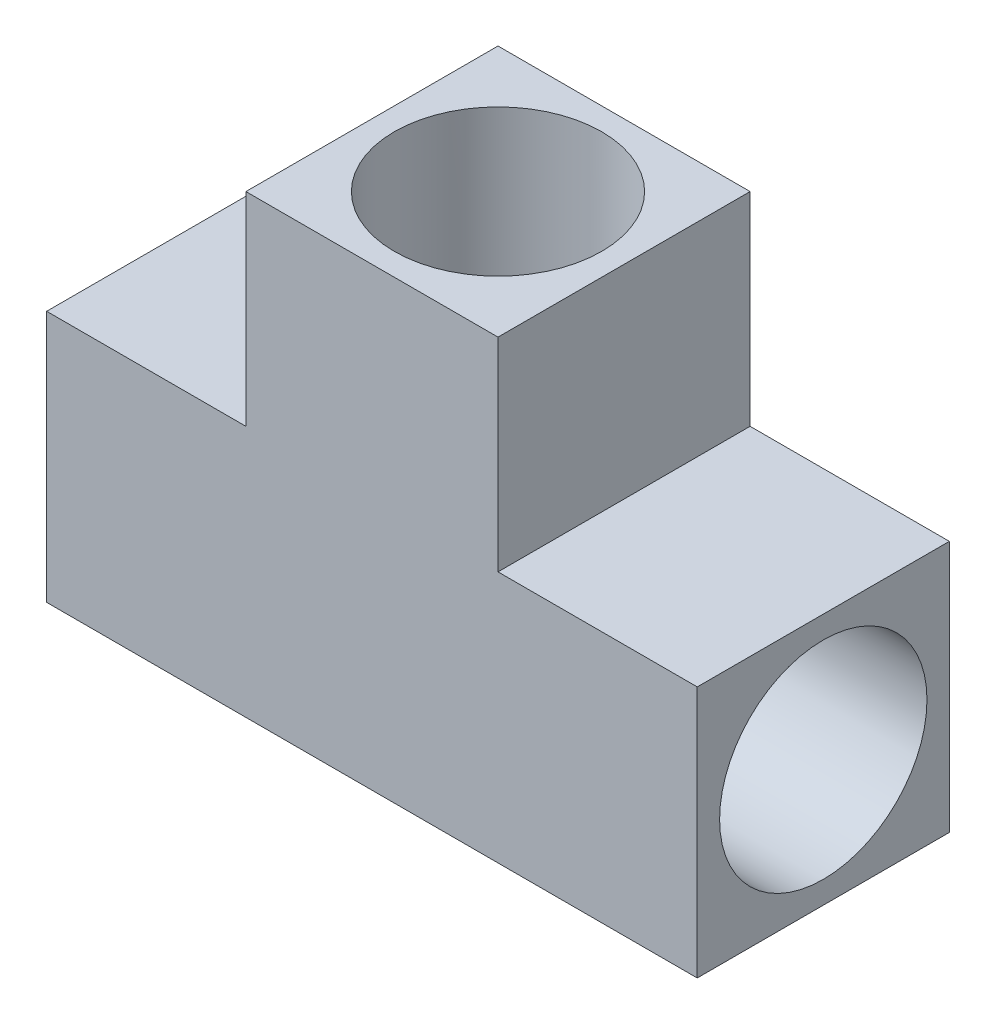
ISO-10303-21;
HEADER;
FILE_DESCRIPTION(('STEP AP214'),'2;1');
FILE_NAME('part.step','',(''),(''),'','','');
FILE_SCHEMA(('AUTOMOTIVE_DESIGN { 1 0 10303 214 1 1 1 1 }'));
ENDSEC;
DATA;
#1=APPLICATION_CONTEXT('core data for automotive mechanical design processes');
#2=APPLICATION_PROTOCOL_DEFINITION('international standard','automotive_design',2000,#1);
#3=PRODUCT_CONTEXT('',#1,'mechanical');
#4=PRODUCT('Part','Part','',(#3));
#5=PRODUCT_RELATED_PRODUCT_CATEGORY('part','',(#4));
#6=PRODUCT_DEFINITION_FORMATION('','',#4);
#7=PRODUCT_DEFINITION_CONTEXT('part definition',#1,'design');
#8=PRODUCT_DEFINITION('design','',#6,#7);
#9=PRODUCT_DEFINITION_SHAPE('','',#8);
#10=(LENGTH_UNIT() NAMED_UNIT(*) SI_UNIT(.MILLI.,.METRE.));
#11=(NAMED_UNIT(*) PLANE_ANGLE_UNIT() SI_UNIT($,.RADIAN.));
#12=(NAMED_UNIT(*) SI_UNIT($,.STERADIAN.) SOLID_ANGLE_UNIT());
#13=UNCERTAINTY_MEASURE_WITH_UNIT(LENGTH_MEASURE(1.E-05),#10,'distance_accuracy_value','');
#14=(GEOMETRIC_REPRESENTATION_CONTEXT(3) GLOBAL_UNCERTAINTY_ASSIGNED_CONTEXT((#13)) GLOBAL_UNIT_ASSIGNED_CONTEXT((#10,
#11,#12)) REPRESENTATION_CONTEXT('',''));
#15=CARTESIAN_POINT('',(0.,0.,0.));
#16=DIRECTION('',(0.,0.,1.));
#17=DIRECTION('',(1.,0.,0.));
#18=AXIS2_PLACEMENT_3D('',#15,#16,#17);
#19=CARTESIAN_POINT('',(10.16,3.937,3.937));
#20=DIRECTION('',(-1.,0.,0.));
#21=DIRECTION('',(0.,0.,1.));
#22=AXIS2_PLACEMENT_3D('',#19,#20,#21);
#23=CYLINDRICAL_SURFACE('',#22,3.2385);
#24=CARTESIAN_POINT('',(10.16,3.937,3.937));
#25=DIRECTION('',(-1.,0.,0.));
#26=DIRECTION('',(0.,0.,1.));
#27=AXIS2_PLACEMENT_3D('',#24,#25,#26);
#28=CIRCLE('',#27,3.2385);
#29=CARTESIAN_POINT('',(10.16,3.937,7.1755));
#30=VERTEX_POINT('',#29);
#31=EDGE_CURVE('E193',#30,#30,#28,.T.);
#32=ORIENTED_EDGE('',*,*,#31,.F.);
#33=EDGE_LOOP('',(#32));
#34=FACE_BOUND('',#33,.T.);
#35=CARTESIAN_POINT('',(0.,3.937,3.937));
#36=DIRECTION('',(-0.707106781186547,0.707106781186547,0.));
#37=DIRECTION('',(-0.707106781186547,-0.707106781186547,0.));
#38=AXIS2_PLACEMENT_3D('',#35,#36,#37);
#39=ELLIPSE('',#38,4.57993062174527,3.2385);
#40=CARTESIAN_POINT('',(0.,3.937,7.1755));
#41=VERTEX_POINT('',#40);
#42=CARTESIAN_POINT('',(0.,3.937,0.698499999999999));
#43=VERTEX_POINT('',#42);
#44=EDGE_CURVE('E123',#41,#43,#39,.T.);
#45=ORIENTED_EDGE('',*,*,#44,.T.);
#46=CARTESIAN_POINT('',(0.,3.937,3.937));
#47=DIRECTION('',(-0.707106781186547,-0.707106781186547,0.));
#48=DIRECTION('',(-0.707106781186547,0.707106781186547,0.));
#49=AXIS2_PLACEMENT_3D('',#46,#47,#48);
#50=ELLIPSE('',#49,4.57993062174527,3.2385);
#51=CARTESIAN_POINT('',(3.2385,0.698499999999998,3.937));
#52=VERTEX_POINT('',#51);
#53=EDGE_CURVE('E11',#43,#52,#50,.T.);
#54=ORIENTED_EDGE('',*,*,#53,.T.);
#55=EDGE_CURVE('E44',#52,#41,#50,.T.);
#56=ORIENTED_EDGE('',*,*,#55,.T.);
#57=EDGE_LOOP('',(#45,#54,#56));
#58=FACE_BOUND('',#57,.T.);
#59=ADVANCED_FACE('F34',(#34,#58),#23,.F.);
#60=CARTESIAN_POINT('',(10.16,7.874,7.874));
#61=DIRECTION('',(0.,-1.,0.));
#62=DIRECTION('',(0.,0.,-1.));
#63=AXIS2_PLACEMENT_3D('',#60,#61,#62);
#64=PLANE('',#63);
#65=DIRECTION('',(-1.,0.,0.));
#66=VECTOR('',#65,1.);
#67=CARTESIAN_POINT('',(10.16,7.874,0.));
#68=LINE('',#67,#66);
#69=CARTESIAN_POINT('',(10.16,7.874,0.));
#70=VERTEX_POINT('',#69);
#71=CARTESIAN_POINT('',(3.937,7.874,0.));
#72=VERTEX_POINT('',#71);
#73=EDGE_CURVE('E190',#70,#72,#68,.T.);
#74=ORIENTED_EDGE('',*,*,#73,.T.);
#75=DIRECTION('',(0.,0.,-1.));
#76=VECTOR('',#75,1.);
#77=CARTESIAN_POINT('',(3.937,7.874,7.874));
#78=LINE('',#77,#76);
#79=CARTESIAN_POINT('',(3.937,7.874,7.874));
#80=VERTEX_POINT('',#79);
#81=EDGE_CURVE('E124',#80,#72,#78,.T.);
#82=ORIENTED_EDGE('',*,*,#81,.F.);
#83=DIRECTION('',(-1.,0.,0.));
#84=VECTOR('',#83,1.);
#85=CARTESIAN_POINT('',(10.16,7.874,7.874));
#86=LINE('',#85,#84);
#87=CARTESIAN_POINT('',(10.16,7.874,7.874));
#88=VERTEX_POINT('',#87);
#89=EDGE_CURVE('E174',#88,#80,#86,.T.);
#90=ORIENTED_EDGE('',*,*,#89,.F.);
#91=DIRECTION('',(0.,0.,-1.));
#92=VECTOR('',#91,1.);
#93=CARTESIAN_POINT('',(10.16,7.874,7.874));
#94=LINE('',#93,#92);
#95=EDGE_CURVE('E158',#88,#70,#94,.T.);
#96=ORIENTED_EDGE('',*,*,#95,.T.);
#97=EDGE_LOOP('',(#74,#82,#90,#96));
#98=FACE_BOUND('',#97,.T.);
#99=ADVANCED_FACE('F36',(#98),#64,.F.);
#100=CARTESIAN_POINT('',(3.937,14.224,7.874));
#101=DIRECTION('',(-1.,0.,0.));
#102=DIRECTION('',(0.,0.,1.));
#103=AXIS2_PLACEMENT_3D('',#100,#101,#102);
#104=PLANE('',#103);
#105=DIRECTION('',(0.,1.,0.));
#106=VECTOR('',#105,1.);
#107=CARTESIAN_POINT('',(3.937,14.224,0.));
#108=LINE('',#107,#106);
#109=CARTESIAN_POINT('',(3.937,14.224,0.));
#110=VERTEX_POINT('',#109);
#111=EDGE_CURVE('E188',#72,#110,#108,.T.);
#112=ORIENTED_EDGE('',*,*,#111,.T.);
#113=DIRECTION('',(0.,0.,-1.));
#114=VECTOR('',#113,1.);
#115=CARTESIAN_POINT('',(3.937,14.224,7.874));
#116=LINE('',#115,#114);
#117=CARTESIAN_POINT('',(3.937,14.224,7.874));
#118=VERTEX_POINT('',#117);
#119=EDGE_CURVE('E140',#118,#110,#116,.T.);
#120=ORIENTED_EDGE('',*,*,#119,.F.);
#121=DIRECTION('',(0.,1.,0.));
#122=VECTOR('',#121,1.);
#123=CARTESIAN_POINT('',(3.937,14.224,7.874));
#124=LINE('',#123,#122);
#125=EDGE_CURVE('E172',#80,#118,#124,.T.);
#126=ORIENTED_EDGE('',*,*,#125,.F.);
#127=ORIENTED_EDGE('',*,*,#81,.T.);
#128=EDGE_LOOP('',(#112,#120,#126,#127));
#129=FACE_BOUND('',#128,.T.);
#130=ADVANCED_FACE('F207',(#129),#104,.F.);
#131=CARTESIAN_POINT('',(-3.937,14.224,7.874));
#132=DIRECTION('',(0.,-1.,0.));
#133=DIRECTION('',(0.,0.,-1.));
#134=AXIS2_PLACEMENT_3D('',#131,#132,#133);
#135=PLANE('',#134);
#136=CARTESIAN_POINT('',(0.,14.224,3.937));
#137=DIRECTION('',(0.,1.,0.));
#138=DIRECTION('',(0.,0.,1.));
#139=AXIS2_PLACEMENT_3D('',#136,#137,#138);
#140=CIRCLE('',#139,3.2385);
#141=CARTESIAN_POINT('',(0.,14.224,7.1755));
#142=VERTEX_POINT('',#141);
#143=EDGE_CURVE('E129',#142,#142,#140,.T.);
#144=ORIENTED_EDGE('',*,*,#143,.F.);
#145=EDGE_LOOP('',(#144));
#146=FACE_BOUND('',#145,.T.);
#147=DIRECTION('',(-1.,0.,0.));
#148=VECTOR('',#147,1.);
#149=CARTESIAN_POINT('',(-3.937,14.224,0.));
#150=LINE('',#149,#148);
#151=CARTESIAN_POINT('',(-3.937,14.224,0.));
#152=VERTEX_POINT('',#151);
#153=EDGE_CURVE('E186',#110,#152,#150,.T.);
#154=ORIENTED_EDGE('',*,*,#153,.T.);
#155=DIRECTION('',(0.,0.,-1.));
#156=VECTOR('',#155,1.);
#157=CARTESIAN_POINT('',(-3.937,14.224,7.874));
#158=LINE('',#157,#156);
#159=CARTESIAN_POINT('',(-3.937,14.224,7.874));
#160=VERTEX_POINT('',#159);
#161=EDGE_CURVE('E143',#160,#152,#158,.T.);
#162=ORIENTED_EDGE('',*,*,#161,.F.);
#163=DIRECTION('',(-1.,0.,0.));
#164=VECTOR('',#163,1.);
#165=CARTESIAN_POINT('',(-3.937,14.224,7.874));
#166=LINE('',#165,#164);
#167=EDGE_CURVE('E170',#118,#160,#166,.T.);
#168=ORIENTED_EDGE('',*,*,#167,.F.);
#169=ORIENTED_EDGE('',*,*,#119,.T.);
#170=EDGE_LOOP('',(#154,#162,#168,#169));
#171=FACE_BOUND('',#170,.T.);
#172=ADVANCED_FACE('F203',(#146,#171),#135,.F.);
#173=CARTESIAN_POINT('',(-3.937,7.874,7.874));
#174=DIRECTION('',(1.,0.,0.));
#175=DIRECTION('',(0.,0.,-1.));
#176=AXIS2_PLACEMENT_3D('',#173,#174,#175);
#177=PLANE('',#176);
#178=DIRECTION('',(0.,-1.,0.));
#179=VECTOR('',#178,1.);
#180=CARTESIAN_POINT('',(-3.937,7.874,0.));
#181=LINE('',#180,#179);
#182=CARTESIAN_POINT('',(-3.937,7.874,0.));
#183=VERTEX_POINT('',#182);
#184=EDGE_CURVE('E184',#152,#183,#181,.T.);
#185=ORIENTED_EDGE('',*,*,#184,.T.);
#186=DIRECTION('',(0.,0.,-1.));
#187=VECTOR('',#186,1.);
#188=CARTESIAN_POINT('',(-3.937,7.874,7.874));
#189=LINE('',#188,#187);
#190=CARTESIAN_POINT('',(-3.937,7.874,7.874));
#191=VERTEX_POINT('',#190);
#192=EDGE_CURVE('E146',#191,#183,#189,.T.);
#193=ORIENTED_EDGE('',*,*,#192,.F.);
#194=DIRECTION('',(0.,-1.,0.));
#195=VECTOR('',#194,1.);
#196=CARTESIAN_POINT('',(-3.937,7.874,7.874));
#197=LINE('',#196,#195);
#198=EDGE_CURVE('E168',#160,#191,#197,.T.);
#199=ORIENTED_EDGE('',*,*,#198,.F.);
#200=ORIENTED_EDGE('',*,*,#161,.T.);
#201=EDGE_LOOP('',(#185,#193,#199,#200));
#202=FACE_BOUND('',#201,.T.);
#203=ADVANCED_FACE('F206',(#202),#177,.F.);
#204=CARTESIAN_POINT('',(-10.16,7.874,7.874));
#205=DIRECTION('',(0.,-1.,0.));
#206=DIRECTION('',(0.,0.,-1.));
#207=AXIS2_PLACEMENT_3D('',#204,#205,#206);
#208=PLANE('',#207);
#209=DIRECTION('',(-1.,0.,0.));
#210=VECTOR('',#209,1.);
#211=CARTESIAN_POINT('',(-10.16,7.874,0.));
#212=LINE('',#211,#210);
#213=CARTESIAN_POINT('',(-10.16,7.874,0.));
#214=VERTEX_POINT('',#213);
#215=EDGE_CURVE('E182',#183,#214,#212,.T.);
#216=ORIENTED_EDGE('',*,*,#215,.T.);
#217=DIRECTION('',(0.,0.,-1.));
#218=VECTOR('',#217,1.);
#219=CARTESIAN_POINT('',(-10.16,7.874,7.874));
#220=LINE('',#219,#218);
#221=CARTESIAN_POINT('',(-10.16,7.874,7.874));
#222=VERTEX_POINT('',#221);
#223=EDGE_CURVE('E149',#222,#214,#220,.T.);
#224=ORIENTED_EDGE('',*,*,#223,.F.);
#225=DIRECTION('',(-1.,0.,0.));
#226=VECTOR('',#225,1.);
#227=CARTESIAN_POINT('',(-10.16,7.874,7.874));
#228=LINE('',#227,#226);
#229=EDGE_CURVE('E166',#191,#222,#228,.T.);
#230=ORIENTED_EDGE('',*,*,#229,.F.);
#231=ORIENTED_EDGE('',*,*,#192,.T.);
#232=EDGE_LOOP('',(#216,#224,#230,#231));
#233=FACE_BOUND('',#232,.T.);
#234=ADVANCED_FACE('F225',(#233),#208,.F.);
#235=CARTESIAN_POINT('',(-10.16,0.,7.874));
#236=DIRECTION('',(1.,0.,0.));
#237=DIRECTION('',(0.,0.,-1.));
#238=AXIS2_PLACEMENT_3D('',#235,#236,#237);
#239=PLANE('',#238);
#240=CARTESIAN_POINT('',(-10.16,3.937,3.937));
#241=DIRECTION('',(-1.,0.,0.));
#242=DIRECTION('',(0.,0.,1.));
#243=AXIS2_PLACEMENT_3D('',#240,#241,#242);
#244=CIRCLE('',#243,3.2385);
#245=CARTESIAN_POINT('',(-10.16,3.937,7.1755));
#246=VERTEX_POINT('',#245);
#247=EDGE_CURVE('E134',#246,#246,#244,.T.);
#248=ORIENTED_EDGE('',*,*,#247,.F.);
#249=EDGE_LOOP('',(#248));
#250=FACE_BOUND('',#249,.T.);
#251=DIRECTION('',(0.,-1.,0.));
#252=VECTOR('',#251,1.);
#253=CARTESIAN_POINT('',(-10.16,0.,0.));
#254=LINE('',#253,#252);
#255=CARTESIAN_POINT('',(-10.16,0.,0.));
#256=VERTEX_POINT('',#255);
#257=EDGE_CURVE('E180',#214,#256,#254,.T.);
#258=ORIENTED_EDGE('',*,*,#257,.T.);
#259=DIRECTION('',(0.,0.,-1.));
#260=VECTOR('',#259,1.);
#261=CARTESIAN_POINT('',(-10.16,0.,7.874));
#262=LINE('',#261,#260);
#263=CARTESIAN_POINT('',(-10.16,0.,7.874));
#264=VERTEX_POINT('',#263);
#265=EDGE_CURVE('E152',#264,#256,#262,.T.);
#266=ORIENTED_EDGE('',*,*,#265,.F.);
#267=DIRECTION('',(0.,-1.,0.));
#268=VECTOR('',#267,1.);
#269=CARTESIAN_POINT('',(-10.16,0.,7.874));
#270=LINE('',#269,#268);
#271=EDGE_CURVE('E164',#222,#264,#270,.T.);
#272=ORIENTED_EDGE('',*,*,#271,.F.);
#273=ORIENTED_EDGE('',*,*,#223,.T.);
#274=EDGE_LOOP('',(#258,#266,#272,#273));
#275=FACE_BOUND('',#274,.T.);
#276=ADVANCED_FACE('F229',(#250,#275),#239,.F.);
#277=CARTESIAN_POINT('',(-10.16,0.,7.874));
#278=DIRECTION('',(0.,1.,0.));
#279=DIRECTION('',(-1.,0.,0.));
#280=AXIS2_PLACEMENT_3D('',#277,#278,#279);
#281=PLANE('',#280);
#282=DIRECTION('',(1.,0.,0.));
#283=VECTOR('',#282,1.);
#284=CARTESIAN_POINT('',(-10.16,0.,0.));
#285=LINE('',#284,#283);
#286=CARTESIAN_POINT('',(10.16,0.,0.));
#287=VERTEX_POINT('',#286);
#288=EDGE_CURVE('E178',#256,#287,#285,.T.);
#289=ORIENTED_EDGE('',*,*,#288,.T.);
#290=DIRECTION('',(0.,0.,-1.));
#291=VECTOR('',#290,1.);
#292=CARTESIAN_POINT('',(10.16,0.,7.874));
#293=LINE('',#292,#291);
#294=CARTESIAN_POINT('',(10.16,0.,7.874));
#295=VERTEX_POINT('',#294);
#296=EDGE_CURVE('E155',#295,#287,#293,.T.);
#297=ORIENTED_EDGE('',*,*,#296,.F.);
#298=DIRECTION('',(1.,0.,0.));
#299=VECTOR('',#298,1.);
#300=CARTESIAN_POINT('',(-10.16,0.,7.874));
#301=LINE('',#300,#299);
#302=EDGE_CURVE('E162',#264,#295,#301,.T.);
#303=ORIENTED_EDGE('',*,*,#302,.F.);
#304=ORIENTED_EDGE('',*,*,#265,.T.);
#305=EDGE_LOOP('',(#289,#297,#303,#304));
#306=FACE_BOUND('',#305,.T.);
#307=ADVANCED_FACE('F242',(#306),#281,.F.);
#308=CARTESIAN_POINT('',(10.16,0.,7.874));
#309=DIRECTION('',(-1.,0.,0.));
#310=DIRECTION('',(0.,0.,1.));
#311=AXIS2_PLACEMENT_3D('',#308,#309,#310);
#312=PLANE('',#311);
#313=ORIENTED_EDGE('',*,*,#31,.T.);
#314=EDGE_LOOP('',(#313));
#315=FACE_BOUND('',#314,.T.);
#316=DIRECTION('',(0.,1.,0.));
#317=VECTOR('',#316,1.);
#318=CARTESIAN_POINT('',(10.16,0.,0.));
#319=LINE('',#318,#317);
#320=EDGE_CURVE('E176',#287,#70,#319,.T.);
#321=ORIENTED_EDGE('',*,*,#320,.T.);
#322=ORIENTED_EDGE('',*,*,#95,.F.);
#323=DIRECTION('',(0.,1.,0.));
#324=VECTOR('',#323,1.);
#325=CARTESIAN_POINT('',(10.16,0.,7.874));
#326=LINE('',#325,#324);
#327=EDGE_CURVE('E58',#295,#88,#326,.T.);
#328=ORIENTED_EDGE('',*,*,#327,.F.);
#329=ORIENTED_EDGE('',*,*,#296,.T.);
#330=EDGE_LOOP('',(#321,#322,#328,#329));
#331=FACE_BOUND('',#330,.T.);
#332=ADVANCED_FACE('F240',(#315,#331),#312,.F.);
#333=CARTESIAN_POINT('',(3.937,7.874,7.874));
#334=DIRECTION('',(0.,0.,1.));
#335=DIRECTION('',(1.,0.,0.));
#336=AXIS2_PLACEMENT_3D('',#333,#334,#335);
#337=PLANE('',#336);
#338=ORIENTED_EDGE('',*,*,#89,.T.);
#339=ORIENTED_EDGE('',*,*,#125,.T.);
#340=ORIENTED_EDGE('',*,*,#167,.T.);
#341=ORIENTED_EDGE('',*,*,#198,.T.);
#342=ORIENTED_EDGE('',*,*,#229,.T.);
#343=ORIENTED_EDGE('',*,*,#271,.T.);
#344=ORIENTED_EDGE('',*,*,#302,.T.);
#345=ORIENTED_EDGE('',*,*,#327,.T.);
#346=EDGE_LOOP('',(#338,#339,#340,#341,#342,#343,#344,#345));
#347=FACE_BOUND('',#346,.T.);
#348=ADVANCED_FACE('F232',(#347),#337,.T.);
#349=CARTESIAN_POINT('',(3.937,7.874,0.));
#350=DIRECTION('',(0.,0.,1.));
#351=DIRECTION('',(1.,0.,0.));
#352=AXIS2_PLACEMENT_3D('',#349,#350,#351);
#353=PLANE('',#352);
#354=ORIENTED_EDGE('',*,*,#73,.F.);
#355=ORIENTED_EDGE('',*,*,#320,.F.);
#356=ORIENTED_EDGE('',*,*,#288,.F.);
#357=ORIENTED_EDGE('',*,*,#257,.F.);
#358=ORIENTED_EDGE('',*,*,#215,.F.);
#359=ORIENTED_EDGE('',*,*,#184,.F.);
#360=ORIENTED_EDGE('',*,*,#153,.F.);
#361=ORIENTED_EDGE('',*,*,#111,.F.);
#362=EDGE_LOOP('',(#354,#355,#356,#357,#358,#359,#360,#361));
#363=FACE_BOUND('',#362,.T.);
#364=ADVANCED_FACE('F220',(#363),#353,.F.);
#365=CARTESIAN_POINT('',(0.,3.937,3.937));
#366=DIRECTION('',(-0.707106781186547,0.707106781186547,0.));
#367=DIRECTION('',(-0.707106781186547,-0.707106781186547,0.));
#368=AXIS2_PLACEMENT_3D('',#365,#366,#367);
#369=ELLIPSE('',#368,4.57993062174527,3.2385);
#370=CARTESIAN_POINT('',(-3.2385,0.698499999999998,3.937));
#371=VERTEX_POINT('',#370);
#372=EDGE_CURVE('E133',#371,#43,#369,.F.);
#373=ORIENTED_EDGE('',*,*,#372,.T.);
#374=CARTESIAN_POINT('',(0.,3.937,3.937));
#375=DIRECTION('',(-0.707106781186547,-0.707106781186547,0.));
#376=DIRECTION('',(-0.707106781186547,0.707106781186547,0.));
#377=AXIS2_PLACEMENT_3D('',#374,#375,#376);
#378=ELLIPSE('',#377,4.57993062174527,3.2385);
#379=EDGE_CURVE('E38',#43,#41,#378,.F.);
#380=ORIENTED_EDGE('',*,*,#379,.T.);
#381=EDGE_CURVE('E120',#41,#371,#369,.F.);
#382=ORIENTED_EDGE('',*,*,#381,.T.);
#383=EDGE_LOOP('',(#373,#380,#382));
#384=FACE_BOUND('',#383,.T.);
#385=ORIENTED_EDGE('',*,*,#247,.T.);
#386=EDGE_LOOP('',(#385));
#387=FACE_BOUND('',#386,.T.);
#388=ADVANCED_FACE('F256',(#384,#387),#23,.F.);
#389=CARTESIAN_POINT('',(0.,0.698499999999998,3.937));
#390=DIRECTION('',(0.,1.,0.));
#391=DIRECTION('',(0.,0.,1.));
#392=AXIS2_PLACEMENT_3D('',#389,#390,#391);
#393=CYLINDRICAL_SURFACE('',#392,3.2385);
#394=ORIENTED_EDGE('',*,*,#143,.T.);
#395=EDGE_LOOP('',(#394));
#396=FACE_BOUND('',#395,.T.);
#397=ORIENTED_EDGE('',*,*,#379,.F.);
#398=ORIENTED_EDGE('',*,*,#44,.F.);
#399=EDGE_LOOP('',(#397,#398));
#400=FACE_BOUND('',#399,.T.);
#401=ADVANCED_FACE('F201',(#396,#400),#393,.F.);
#402=CARTESIAN_POINT('',(0.,0.698499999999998,3.937));
#403=DIRECTION('',(0.,1.,0.));
#404=DIRECTION('',(0.,0.,1.));
#405=AXIS2_PLACEMENT_3D('',#402,#403,#404);
#406=CIRCLE('',#405,3.2385);
#407=EDGE_CURVE('E128',#52,#371,#406,.T.);
#408=ORIENTED_EDGE('',*,*,#407,.F.);
#409=ORIENTED_EDGE('',*,*,#53,.F.);
#410=ORIENTED_EDGE('',*,*,#372,.F.);
#411=EDGE_LOOP('',(#408,#409,#410));
#412=FACE_BOUND('',#411,.T.);
#413=ADVANCED_FACE('F132',(#412),#393,.F.);
#414=ORIENTED_EDGE('',*,*,#55,.F.);
#415=EDGE_CURVE('E118',#371,#52,#406,.T.);
#416=ORIENTED_EDGE('',*,*,#415,.F.);
#417=ORIENTED_EDGE('',*,*,#381,.F.);
#418=EDGE_LOOP('',(#414,#416,#417));
#419=FACE_BOUND('',#418,.T.);
#420=ADVANCED_FACE('F117',(#419),#393,.F.);
#421=CARTESIAN_POINT('',(0.,0.698499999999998,3.937));
#422=DIRECTION('',(0.,1.,0.));
#423=DIRECTION('',(0.,0.,1.));
#424=AXIS2_PLACEMENT_3D('',#421,#422,#423);
#425=PLANE('',#424);
#426=ORIENTED_EDGE('',*,*,#407,.T.);
#427=ORIENTED_EDGE('',*,*,#415,.T.);
#428=EDGE_LOOP('',(#426,#427));
#429=FACE_BOUND('',#428,.T.);
#430=ADVANCED_FACE('F127',(#429),#425,.T.);
#431=CLOSED_SHELL('',(#59,#99,#130,#172,#203,#234,#276,#307,#332,#348,#364,#388,#401,#413,#420,#430));
#432=MANIFOLD_SOLID_BREP('B2',#431);
#433=ADVANCED_BREP_SHAPE_REPRESENTATION('',(#18,#432),#14);
#434=SHAPE_DEFINITION_REPRESENTATION(#9,#433);
ENDSEC;
END-ISO-10303-21;
